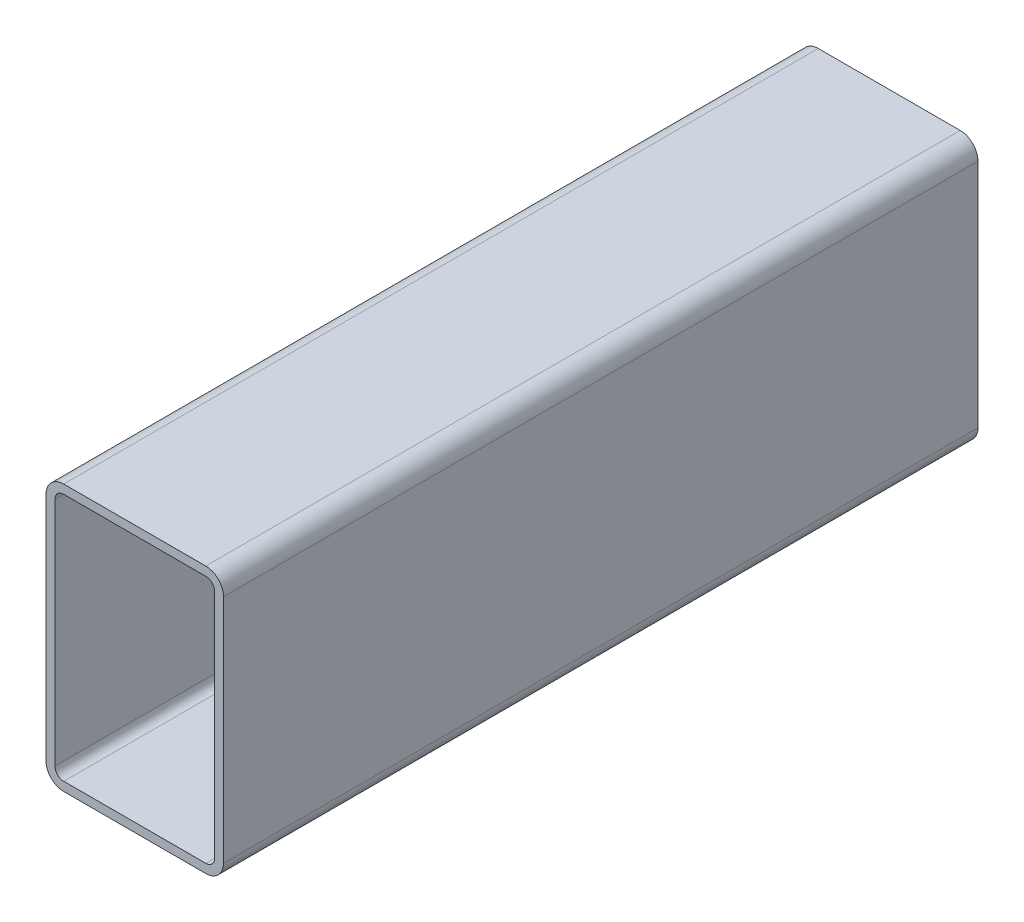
from build123d import *

# Parameters (mm, degrees)
BASE_EXTRU_MINCE_DEPTH = 85


with BuildPart() as part:
    # Esquisse1 → Base-Extru.-Mince (new, symmetric)
    with BuildSketch(Plane.XY):
        with BuildLine():
            Line((20, -26), (20, 26))
            ThreePointArc((20, 26), (18.828427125, 28.828427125), (16, 30))
            Line((16, 30), (-16, 30))
            ThreePointArc((-16, 30), (-18.828427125, 28.828427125), (-20, 26))
            Line((-20, 26), (-20, -26))
            ThreePointArc((-20, -26), (-18.828427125, -28.828427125), (-16, -30))
            Line((-16, -30), (16, -30))
            ThreePointArc((16, -30), (18.828427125, -28.828427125), (20, -26))
        make_face()
        with BuildLine():
            Line((18, -26), (18, 26))
            ThreePointArc((18, 26), (17.414213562, 27.414213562), (16, 28))
            Line((16, 28), (-16, 28))
            ThreePointArc((-16, 28), (-17.414213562, 27.414213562), (-18, 26))
            Line((-18, 26), (-18, -26))
            ThreePointArc((-18, -26), (-17.414213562, -27.414213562), (-16, -28))
            Line((-16, -28), (16, -28))
            ThreePointArc((16, -28), (17.414213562, -27.414213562), (18, -26))
        make_face(mode=Mode.SUBTRACT)
    extrude(amount=BASE_EXTRU_MINCE_DEPTH, both=True)


solid = part.part
